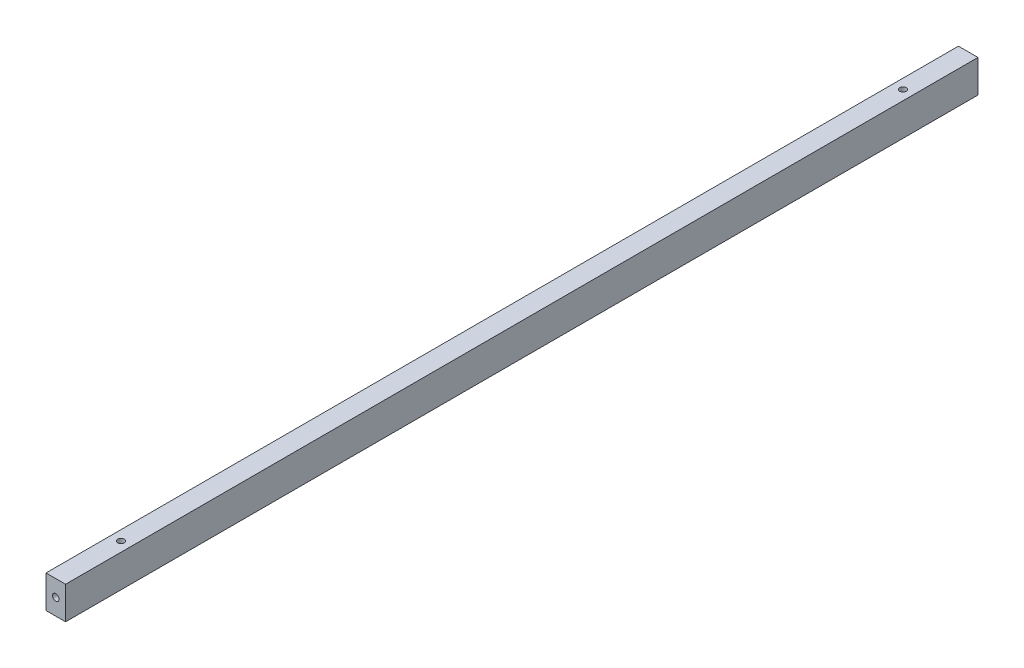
ISO-10303-21;
HEADER;
FILE_DESCRIPTION(('STEP AP214'),'2;1');
FILE_NAME('part.step','',(''),(''),'','','');
FILE_SCHEMA(('AUTOMOTIVE_DESIGN { 1 0 10303 214 1 1 1 1 }'));
ENDSEC;
DATA;
#1=APPLICATION_CONTEXT('core data for automotive mechanical design processes');
#2=APPLICATION_PROTOCOL_DEFINITION('international standard','automotive_design',2000,#1);
#3=PRODUCT_CONTEXT('',#1,'mechanical');
#4=PRODUCT('Part','Part','',(#3));
#5=PRODUCT_RELATED_PRODUCT_CATEGORY('part','',(#4));
#6=PRODUCT_DEFINITION_FORMATION('','',#4);
#7=PRODUCT_DEFINITION_CONTEXT('part definition',#1,'design');
#8=PRODUCT_DEFINITION('design','',#6,#7);
#9=PRODUCT_DEFINITION_SHAPE('','',#8);
#10=(LENGTH_UNIT() NAMED_UNIT(*) SI_UNIT(.MILLI.,.METRE.));
#11=(NAMED_UNIT(*) PLANE_ANGLE_UNIT() SI_UNIT($,.RADIAN.));
#12=(NAMED_UNIT(*) SI_UNIT($,.STERADIAN.) SOLID_ANGLE_UNIT());
#13=UNCERTAINTY_MEASURE_WITH_UNIT(LENGTH_MEASURE(1.E-05),#10,'distance_accuracy_value','');
#14=(GEOMETRIC_REPRESENTATION_CONTEXT(3) GLOBAL_UNCERTAINTY_ASSIGNED_CONTEXT((#13)) GLOBAL_UNIT_ASSIGNED_CONTEXT((#10,
#11,#12)) REPRESENTATION_CONTEXT('',''));
#15=CARTESIAN_POINT('',(0.,0.,0.));
#16=DIRECTION('',(0.,0.,1.));
#17=DIRECTION('',(1.,0.,0.));
#18=AXIS2_PLACEMENT_3D('',#15,#16,#17);
#19=CARTESIAN_POINT('',(-7.5,-12.5,350.));
#20=DIRECTION('',(1.,0.,0.));
#21=DIRECTION('',(0.,0.,-1.));
#22=AXIS2_PLACEMENT_3D('',#19,#20,#21);
#23=PLANE('',#22);
#24=DIRECTION('',(0.,-1.,0.));
#25=VECTOR('',#24,1.);
#26=CARTESIAN_POINT('',(-7.5,-12.5,-350.));
#27=LINE('',#26,#25);
#28=CARTESIAN_POINT('',(-7.5,12.5,-350.));
#29=VERTEX_POINT('',#28);
#30=CARTESIAN_POINT('',(-7.5,-12.5,-350.));
#31=VERTEX_POINT('',#30);
#32=EDGE_CURVE('E119',#29,#31,#27,.T.);
#33=ORIENTED_EDGE('',*,*,#32,.T.);
#34=DIRECTION('',(0.,0.,-1.));
#35=VECTOR('',#34,1.);
#36=CARTESIAN_POINT('',(-7.5,-12.5,350.));
#37=LINE('',#36,#35);
#38=CARTESIAN_POINT('',(-7.5,-12.5,350.));
#39=VERTEX_POINT('',#38);
#40=EDGE_CURVE('E11',#39,#31,#37,.T.);
#41=ORIENTED_EDGE('',*,*,#40,.F.);
#42=DIRECTION('',(0.,-1.,0.));
#43=VECTOR('',#42,1.);
#44=CARTESIAN_POINT('',(-7.5,-12.5,350.));
#45=LINE('',#44,#43);
#46=CARTESIAN_POINT('',(-7.5,12.5,350.));
#47=VERTEX_POINT('',#46);
#48=EDGE_CURVE('E131',#47,#39,#45,.T.);
#49=ORIENTED_EDGE('',*,*,#48,.F.);
#50=DIRECTION('',(0.,0.,-1.));
#51=VECTOR('',#50,1.);
#52=CARTESIAN_POINT('',(-7.5,12.5,350.));
#53=LINE('',#52,#51);
#54=EDGE_CURVE('E141',#47,#29,#53,.T.);
#55=ORIENTED_EDGE('',*,*,#54,.T.);
#56=EDGE_LOOP('',(#33,#41,#49,#55));
#57=FACE_BOUND('',#56,.T.);
#58=ADVANCED_FACE('F42',(#57),#23,.F.);
#59=CARTESIAN_POINT('',(-7.5,-12.5,350.));
#60=DIRECTION('',(0.,1.,0.));
#61=DIRECTION('',(0.,0.,1.));
#62=AXIS2_PLACEMENT_3D('',#59,#60,#61);
#63=PLANE('',#62);
#64=CARTESIAN_POINT('',(0.,-12.5,300.));
#65=DIRECTION('',(0.,1.,0.));
#66=DIRECTION('',(0.,0.,1.));
#67=AXIS2_PLACEMENT_3D('',#64,#65,#66);
#68=CIRCLE('',#67,2.5);
#69=CARTESIAN_POINT('',(0.,-12.5,302.5));
#70=VERTEX_POINT('',#69);
#71=EDGE_CURVE('E206',#70,#70,#68,.T.);
#72=ORIENTED_EDGE('',*,*,#71,.T.);
#73=EDGE_LOOP('',(#72));
#74=FACE_BOUND('',#73,.T.);
#75=CARTESIAN_POINT('',(0.,-12.5,-300.));
#76=DIRECTION('',(0.,1.,0.));
#77=DIRECTION('',(0.,0.,1.));
#78=AXIS2_PLACEMENT_3D('',#75,#76,#77);
#79=CIRCLE('',#78,2.5);
#80=CARTESIAN_POINT('',(0.,-12.5,-297.5));
#81=VERTEX_POINT('',#80);
#82=EDGE_CURVE('E108',#81,#81,#79,.T.);
#83=ORIENTED_EDGE('',*,*,#82,.T.);
#84=EDGE_LOOP('',(#83));
#85=FACE_BOUND('',#84,.T.);
#86=DIRECTION('',(1.,0.,0.));
#87=VECTOR('',#86,1.);
#88=CARTESIAN_POINT('',(-7.5,-12.5,-350.));
#89=LINE('',#88,#87);
#90=CARTESIAN_POINT('',(7.5,-12.5,-350.));
#91=VERTEX_POINT('',#90);
#92=EDGE_CURVE('E123',#31,#91,#89,.T.);
#93=ORIENTED_EDGE('',*,*,#92,.T.);
#94=DIRECTION('',(0.,0.,-1.));
#95=VECTOR('',#94,1.);
#96=CARTESIAN_POINT('',(7.5,-12.5,350.));
#97=LINE('',#96,#95);
#98=CARTESIAN_POINT('',(7.5,-12.5,350.));
#99=VERTEX_POINT('',#98);
#100=EDGE_CURVE('E50',#99,#91,#97,.T.);
#101=ORIENTED_EDGE('',*,*,#100,.F.);
#102=DIRECTION('',(1.,0.,0.));
#103=VECTOR('',#102,1.);
#104=CARTESIAN_POINT('',(-7.5,-12.5,350.));
#105=LINE('',#104,#103);
#106=EDGE_CURVE('E134',#39,#99,#105,.T.);
#107=ORIENTED_EDGE('',*,*,#106,.F.);
#108=ORIENTED_EDGE('',*,*,#40,.T.);
#109=EDGE_LOOP('',(#93,#101,#107,#108));
#110=FACE_BOUND('',#109,.T.);
#111=ADVANCED_FACE('F166',(#74,#85,#110),#63,.F.);
#112=CARTESIAN_POINT('',(7.5,-12.5,350.));
#113=DIRECTION('',(-1.,0.,0.));
#114=DIRECTION('',(0.,0.,1.));
#115=AXIS2_PLACEMENT_3D('',#112,#113,#114);
#116=PLANE('',#115);
#117=DIRECTION('',(0.,1.,0.));
#118=VECTOR('',#117,1.);
#119=CARTESIAN_POINT('',(7.5,-12.5,-350.));
#120=LINE('',#119,#118);
#121=CARTESIAN_POINT('',(7.5,12.5,-350.));
#122=VERTEX_POINT('',#121);
#123=EDGE_CURVE('E126',#91,#122,#120,.T.);
#124=ORIENTED_EDGE('',*,*,#123,.T.);
#125=DIRECTION('',(0.,0.,-1.));
#126=VECTOR('',#125,1.);
#127=CARTESIAN_POINT('',(7.5,12.5,350.));
#128=LINE('',#127,#126);
#129=CARTESIAN_POINT('',(7.5,12.5,350.));
#130=VERTEX_POINT('',#129);
#131=EDGE_CURVE('E145',#130,#122,#128,.T.);
#132=ORIENTED_EDGE('',*,*,#131,.F.);
#133=DIRECTION('',(0.,1.,0.));
#134=VECTOR('',#133,1.);
#135=CARTESIAN_POINT('',(7.5,-12.5,350.));
#136=LINE('',#135,#134);
#137=EDGE_CURVE('E62',#99,#130,#136,.T.);
#138=ORIENTED_EDGE('',*,*,#137,.F.);
#139=ORIENTED_EDGE('',*,*,#100,.T.);
#140=EDGE_LOOP('',(#124,#132,#138,#139));
#141=FACE_BOUND('',#140,.T.);
#142=ADVANCED_FACE('F154',(#141),#116,.F.);
#143=CARTESIAN_POINT('',(-7.5,12.5,350.));
#144=DIRECTION('',(0.,-1.,0.));
#145=DIRECTION('',(0.,0.,-1.));
#146=AXIS2_PLACEMENT_3D('',#143,#144,#145);
#147=PLANE('',#146);
#148=CARTESIAN_POINT('',(0.,12.5,300.));
#149=DIRECTION('',(0.,1.,0.));
#150=DIRECTION('',(0.,0.,1.));
#151=AXIS2_PLACEMENT_3D('',#148,#149,#150);
#152=CIRCLE('',#151,2.49999999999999);
#153=CARTESIAN_POINT('',(0.,12.5,302.5));
#154=VERTEX_POINT('',#153);
#155=EDGE_CURVE('E209',#154,#154,#152,.T.);
#156=ORIENTED_EDGE('',*,*,#155,.F.);
#157=EDGE_LOOP('',(#156));
#158=FACE_BOUND('',#157,.T.);
#159=CARTESIAN_POINT('',(0.,12.5,-300.));
#160=DIRECTION('',(0.,1.,0.));
#161=DIRECTION('',(0.,0.,1.));
#162=AXIS2_PLACEMENT_3D('',#159,#160,#161);
#163=CIRCLE('',#162,2.49999999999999);
#164=CARTESIAN_POINT('',(0.,12.5,-297.5));
#165=VERTEX_POINT('',#164);
#166=EDGE_CURVE('E99',#165,#165,#163,.T.);
#167=ORIENTED_EDGE('',*,*,#166,.F.);
#168=EDGE_LOOP('',(#167));
#169=FACE_BOUND('',#168,.T.);
#170=DIRECTION('',(-1.,0.,0.));
#171=VECTOR('',#170,1.);
#172=CARTESIAN_POINT('',(-7.5,12.5,-350.));
#173=LINE('',#172,#171);
#174=EDGE_CURVE('E128',#122,#29,#173,.T.);
#175=ORIENTED_EDGE('',*,*,#174,.T.);
#176=ORIENTED_EDGE('',*,*,#54,.F.);
#177=DIRECTION('',(-1.,0.,0.));
#178=VECTOR('',#177,1.);
#179=CARTESIAN_POINT('',(-7.5,12.5,350.));
#180=LINE('',#179,#178);
#181=EDGE_CURVE('E57',#130,#47,#180,.T.);
#182=ORIENTED_EDGE('',*,*,#181,.F.);
#183=ORIENTED_EDGE('',*,*,#131,.T.);
#184=EDGE_LOOP('',(#175,#176,#182,#183));
#185=FACE_BOUND('',#184,.T.);
#186=ADVANCED_FACE('F161',(#158,#169,#185),#147,.F.);
#187=CARTESIAN_POINT('',(-7.5,12.5,350.));
#188=DIRECTION('',(0.,0.,-1.));
#189=DIRECTION('',(-1.,0.,0.));
#190=AXIS2_PLACEMENT_3D('',#187,#188,#189);
#191=PLANE('',#190);
#192=CARTESIAN_POINT('',(0.,0.,350.));
#193=DIRECTION('',(0.,0.,1.));
#194=DIRECTION('',(1.,0.,0.));
#195=AXIS2_PLACEMENT_3D('',#192,#193,#194);
#196=CIRCLE('',#195,2.49999999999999);
#197=CARTESIAN_POINT('',(2.49999999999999,0.,350.));
#198=VERTEX_POINT('',#197);
#199=EDGE_CURVE('E115',#198,#198,#196,.T.);
#200=ORIENTED_EDGE('',*,*,#199,.F.);
#201=EDGE_LOOP('',(#200));
#202=FACE_BOUND('',#201,.T.);
#203=ORIENTED_EDGE('',*,*,#48,.T.);
#204=ORIENTED_EDGE('',*,*,#106,.T.);
#205=ORIENTED_EDGE('',*,*,#137,.T.);
#206=ORIENTED_EDGE('',*,*,#181,.T.);
#207=EDGE_LOOP('',(#203,#204,#205,#206));
#208=FACE_BOUND('',#207,.T.);
#209=ADVANCED_FACE('F165',(#202,#208),#191,.F.);
#210=CARTESIAN_POINT('',(-7.5,12.5,-350.));
#211=DIRECTION('',(0.,0.,-1.));
#212=DIRECTION('',(-1.,0.,0.));
#213=AXIS2_PLACEMENT_3D('',#210,#211,#212);
#214=PLANE('',#213);
#215=CARTESIAN_POINT('',(0.,0.,-350.));
#216=DIRECTION('',(0.,0.,-1.));
#217=DIRECTION('',(-1.,0.,0.));
#218=AXIS2_PLACEMENT_3D('',#215,#216,#217);
#219=CIRCLE('',#218,2.49999999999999);
#220=CARTESIAN_POINT('',(-2.49999999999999,0.,-350.));
#221=VERTEX_POINT('',#220);
#222=EDGE_CURVE('E98',#221,#221,#219,.T.);
#223=ORIENTED_EDGE('',*,*,#222,.F.);
#224=EDGE_LOOP('',(#223));
#225=FACE_BOUND('',#224,.T.);
#226=ORIENTED_EDGE('',*,*,#32,.F.);
#227=ORIENTED_EDGE('',*,*,#174,.F.);
#228=ORIENTED_EDGE('',*,*,#123,.F.);
#229=ORIENTED_EDGE('',*,*,#92,.F.);
#230=EDGE_LOOP('',(#226,#227,#228,#229));
#231=FACE_BOUND('',#230,.T.);
#232=ADVANCED_FACE('F159',(#225,#231),#214,.T.);
#233=CARTESIAN_POINT('',(0.,0.,350.));
#234=DIRECTION('',(0.,0.,1.));
#235=DIRECTION('',(1.,0.,0.));
#236=AXIS2_PLACEMENT_3D('',#233,#234,#235);
#237=CYLINDRICAL_SURFACE('',#236,2.49999999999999);
#238=CARTESIAN_POINT('',(0.,0.,330.));
#239=DIRECTION('',(0.,0.,1.));
#240=DIRECTION('',(1.,0.,0.));
#241=AXIS2_PLACEMENT_3D('',#238,#239,#240);
#242=CIRCLE('',#241,2.49999999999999);
#243=CARTESIAN_POINT('',(2.49999999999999,0.,330.));
#244=VERTEX_POINT('',#243);
#245=EDGE_CURVE('E104',#244,#244,#242,.T.);
#246=ORIENTED_EDGE('',*,*,#245,.F.);
#247=EDGE_LOOP('',(#246));
#248=FACE_BOUND('',#247,.T.);
#249=ORIENTED_EDGE('',*,*,#199,.T.);
#250=EDGE_LOOP('',(#249));
#251=FACE_BOUND('',#250,.T.);
#252=ADVANCED_FACE('F185',(#248,#251),#237,.F.);
#253=CARTESIAN_POINT('',(0.,0.,330.));
#254=DIRECTION('',(0.,0.,1.));
#255=DIRECTION('',(1.,0.,0.));
#256=AXIS2_PLACEMENT_3D('',#253,#254,#255);
#257=CONICAL_SURFACE('',#256,2.49999999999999,1.02974425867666);
#258=CARTESIAN_POINT('',(0.,0.,328.497848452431));
#259=VERTEX_POINT('',#258);
#260=VERTEX_LOOP('',#259);
#261=FACE_BOUND('',#260,.T.);
#262=ORIENTED_EDGE('',*,*,#245,.T.);
#263=EDGE_LOOP('',(#262));
#264=FACE_BOUND('',#263,.T.);
#265=ADVANCED_FACE('F189',(#261,#264),#257,.F.);
#266=CARTESIAN_POINT('',(0.,0.,-350.));
#267=DIRECTION('',(0.,0.,-1.));
#268=DIRECTION('',(-1.,0.,0.));
#269=AXIS2_PLACEMENT_3D('',#266,#267,#268);
#270=CYLINDRICAL_SURFACE('',#269,2.49999999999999);
#271=CARTESIAN_POINT('',(0.,0.,-330.));
#272=DIRECTION('',(0.,0.,-1.));
#273=DIRECTION('',(-1.,0.,0.));
#274=AXIS2_PLACEMENT_3D('',#271,#272,#273);
#275=CIRCLE('',#274,2.49999999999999);
#276=CARTESIAN_POINT('',(-2.49999999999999,0.,-330.));
#277=VERTEX_POINT('',#276);
#278=EDGE_CURVE('E95',#277,#277,#275,.T.);
#279=ORIENTED_EDGE('',*,*,#278,.F.);
#280=EDGE_LOOP('',(#279));
#281=FACE_BOUND('',#280,.T.);
#282=ORIENTED_EDGE('',*,*,#222,.T.);
#283=EDGE_LOOP('',(#282));
#284=FACE_BOUND('',#283,.T.);
#285=ADVANCED_FACE('F91',(#281,#284),#270,.F.);
#286=CARTESIAN_POINT('',(0.,0.,-330.));
#287=DIRECTION('',(0.,0.,-1.));
#288=DIRECTION('',(-1.,0.,0.));
#289=AXIS2_PLACEMENT_3D('',#286,#287,#288);
#290=CONICAL_SURFACE('',#289,2.49999999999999,1.02974425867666);
#291=CARTESIAN_POINT('',(0.,0.,-328.497848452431));
#292=VERTEX_POINT('',#291);
#293=VERTEX_LOOP('',#292);
#294=FACE_BOUND('',#293,.T.);
#295=ORIENTED_EDGE('',*,*,#278,.T.);
#296=EDGE_LOOP('',(#295));
#297=FACE_BOUND('',#296,.T.);
#298=ADVANCED_FACE('F87',(#294,#297),#290,.F.);
#299=CARTESIAN_POINT('',(0.,12.5,-300.));
#300=DIRECTION('',(0.,1.,0.));
#301=DIRECTION('',(0.,0.,1.));
#302=AXIS2_PLACEMENT_3D('',#299,#300,#301);
#303=CYLINDRICAL_SURFACE('',#302,2.49999999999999);
#304=ORIENTED_EDGE('',*,*,#82,.F.);
#305=EDGE_LOOP('',(#304));
#306=FACE_BOUND('',#305,.T.);
#307=ORIENTED_EDGE('',*,*,#166,.T.);
#308=EDGE_LOOP('',(#307));
#309=FACE_BOUND('',#308,.T.);
#310=ADVANCED_FACE('F90',(#306,#309),#303,.F.);
#311=CARTESIAN_POINT('',(0.,12.5,300.));
#312=DIRECTION('',(0.,1.,0.));
#313=DIRECTION('',(0.,0.,1.));
#314=AXIS2_PLACEMENT_3D('',#311,#312,#313);
#315=CYLINDRICAL_SURFACE('',#314,2.49999999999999);
#316=ORIENTED_EDGE('',*,*,#71,.F.);
#317=EDGE_LOOP('',(#316));
#318=FACE_BOUND('',#317,.T.);
#319=ORIENTED_EDGE('',*,*,#155,.T.);
#320=EDGE_LOOP('',(#319));
#321=FACE_BOUND('',#320,.T.);
#322=ADVANCED_FACE('F198',(#318,#321),#315,.F.);
#323=CLOSED_SHELL('',(#58,#111,#142,#186,#209,#232,#252,#265,#285,#298,#310,#322));
#324=MANIFOLD_SOLID_BREP('B2',#323);
#325=ADVANCED_BREP_SHAPE_REPRESENTATION('',(#18,#324),#14);
#326=SHAPE_DEFINITION_REPRESENTATION(#9,#325);
ENDSEC;
END-ISO-10303-21;
